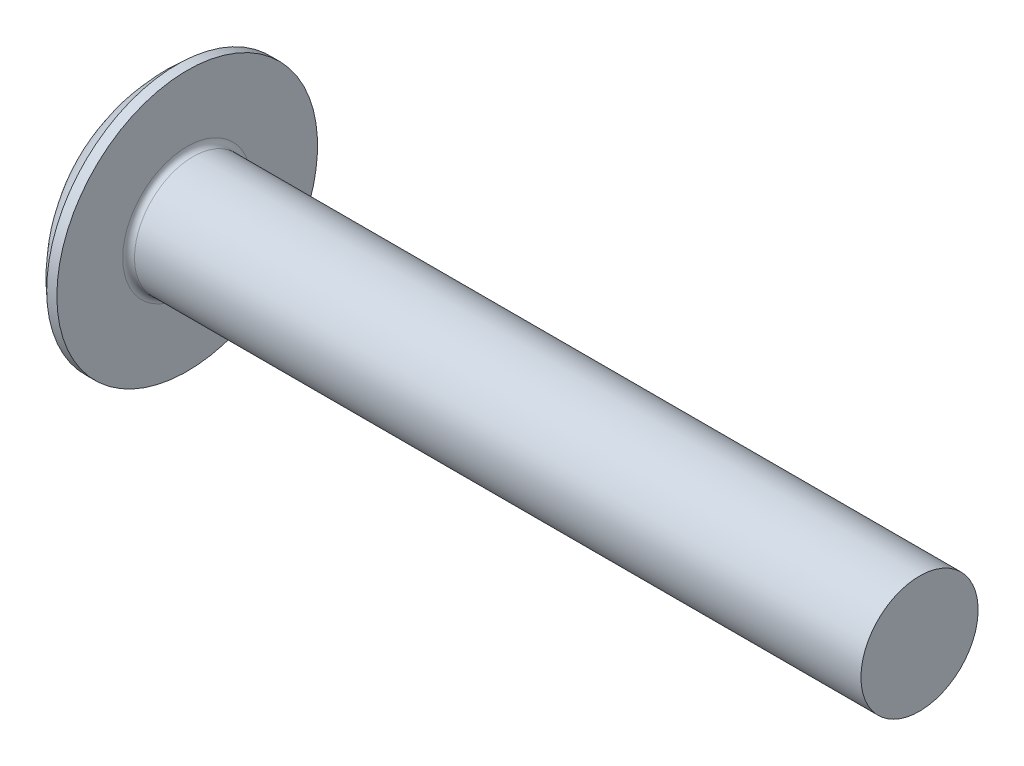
from build123d import *

# Parameters (mm, degrees)
FILLET1_R    = 0.4
RECPAT_COUNT = 2
RECPAT_ANGLE = 90


with BuildPart() as part:
    # BodySke → BaseBody (revolve)
    with BuildSketch(Plane.XY, mode=Mode.PRIVATE) as basebody_sk:
        with BuildLine():
            Line((4.8, 4), (4.8, 8.9))
            Line((4.8, 8.9), (4.105264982, 8.9))
            ThreePointArc((4.105264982, 8.9), (1.075772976, 4.900591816), (0, 0))
            Line((0, 0), (54.8, 0))
            Line((54.8, 0), (54.8, 4))
            Line((54.8, 4), (4.8, 4))
        make_face()
    revolve(basebody_sk.sketch.rotate(Axis((0, 0, 0), (1, 0, 0)), 90), axis=Axis((0, 0, 0), (1, 0, 0)))

    # Fillet1
    fillet1_edges = [part.edges().sort_by_distance(p)[0] for p in [
        (4.8, 0, -4),
    ]]
    fillet(fillet1_edges, radius=FILLET1_R)

    # RecSkeTop → Recess section 0
    with BuildSketch(Plane(origin=(0, 0, 0), x_dir=(0, 0, -1), z_dir=(1, 0, 0))):
        with BuildLine():
            Line((-0.858, 3.9), (0.858, 3.9))
            Line((0.858, 3.9), (0.858, -3.9))
            Line((0.858, -3.9), (-0.858, -3.9))
            Line((-0.858, -3.9), (-0.858, 3.9))
        make_face()
    # RecSkeBot → Recess section 1
    with BuildSketch(Plane(origin=(4.36, 0, 0), x_dir=(0, 0, -1), z_dir=(1, 0, 0))):
        with BuildLine():
            Line((-0.858, 1.726184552), (0.858, 1.726184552))
            Line((0.858, 1.726184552), (0.858, -1.726184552))
            Line((0.858, -1.726184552), (-0.858, -1.726184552))
            Line((-0.858, -1.726184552), (-0.858, 1.726184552))
        make_face()
    recess = loft(mode=Mode.SUBTRACT)

    # RecPat: Recess ×2 about axis
    recpat_axis = Axis((0, 0, 0), (1, 0, 0))
    for i in range(1, RECPAT_COUNT):
        add(recess.rotate(recpat_axis, i * RECPAT_ANGLE / (RECPAT_COUNT - 1)), mode=Mode.SUBTRACT)

    # RecCorSke → RecessCore (revolve, cut)
    with BuildSketch(Plane.XY, mode=Mode.PRIVATE) as recesscore_sk:
        Polygon((0, 0), (0, 1.8876), (4.36, 1.5827191), (4.874256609, 0), align=None)
    revolve(recesscore_sk.sketch.rotate(Axis((0, 0, 0), (1, 0, 0)), 346.596100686), axis=Axis((0, 0, 0), (1, 0, 0)), mode=Mode.SUBTRACT)


solid = part.part
